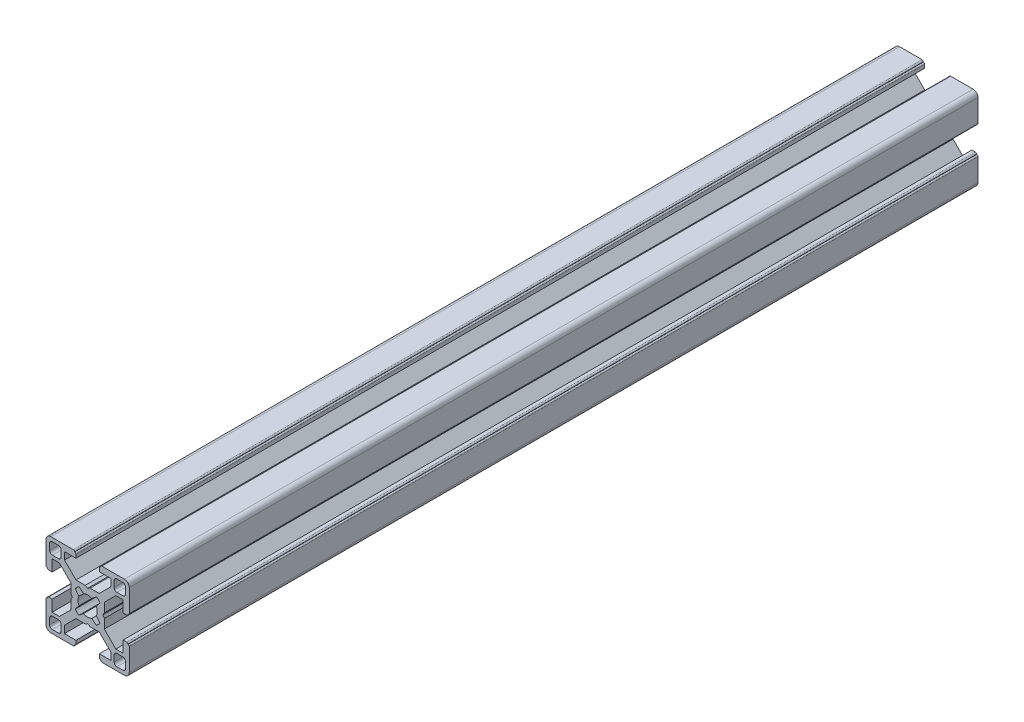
from build123d import *

# Parameters (mm, degrees)
EXTRUSION_3030_DEPTH  = 152.4
PATTERN_EXTRUDE_COUNT = 4


with BuildPart() as part:
    # Sketch1 → Extrusion_3030 (new, symmetric)
    with BuildSketch(Plane.XY):
        with BuildLine():
            Line((-8.325, 12.75), (-4.2, 12.75))
            Line((-4.2, 12.75), (-4.2, 14))
            ThreePointArc((-4.2, 14), (-4.331801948, 14.318198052), (-4.65, 14.45))
            Line((-4.65, 14.45), (-4.7, 14.45))
            Line((-4.7, 14.45), (-4.7, 14.5))
            ThreePointArc((-4.7, 14.5), (-4.831801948, 14.818198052), (-5.15, 14.95))
            Line((-5.15, 14.95), (-13.2, 14.95))
            ThreePointArc((-13.2, 14.95), (-14.437436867, 14.437436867), (-14.95, 13.2))
            Line((-14.95, 13.2), (-14.95, 5.15))
            ThreePointArc((-14.95, 5.15), (-14.818198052, 4.831801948), (-14.5, 4.7))
            Line((-14.5, 4.7), (-14.45, 4.7))
            Line((-14.45, 4.7), (-14.45, 4.65))
            ThreePointArc((-14.45, 4.65), (-14.318198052, 4.331801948), (-14, 4.2))
            Line((-14, 4.2), (-12.75, 4.2))
            Line((-12.75, 4.2), (-12.75, 8.325))
            Line((-12.75, 8.325), (-10.13519336, 8.325))
            Line((-10.13519336, 8.325), (-6, 4.18980664))
            Line((-6, 4.18980664), (-6, 0.875))
            Line((-6, 0.875), (-5.5, 0))
            Line((-5.5, 0), (-3.455011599, 0))
            ThreePointArc((-3.455011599, 0), (-3.369431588, 0.764222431), (-3.116931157, 1.49058556))
            Line((-3.116931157, 1.49058556), (-4.456792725, 3.162787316))
            ThreePointArc((-4.456792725, 3.162787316), (-3.864338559, 3.864338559), (-3.162787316, 4.456792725))
            Line((-3.162787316, 4.456792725), (-1.49058556, 3.116931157))
            ThreePointArc((-1.49058556, 3.116931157), (-0.764222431, 3.369431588), (0, 3.455011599))
            Line((0, 3.455011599), (0, 5.5))
            Line((0, 5.5), (-0.875, 6))
            Line((-0.875, 6), (-4.18980664, 6))
            Line((-4.18980664, 6), (-8.325, 10.13519336))
            Line((-8.325, 10.13519336), (-8.325, 12.75))
        make_face()
        with BuildLine():
            Line((-13.65, 10.5), (-13.65, 12.65))
            ThreePointArc((-13.65, 12.65), (-13.357106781, 13.357106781), (-12.65, 13.65))
            Line((-12.65, 13.65), (-10.5, 13.65))
            ThreePointArc((-10.5, 13.65), (-9.792893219, 13.357106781), (-9.5, 12.65))
            Line((-9.5, 12.65), (-9.5, 10.5))
            ThreePointArc((-9.5, 10.5), (-9.792893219, 9.792893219), (-10.5, 9.5))
            Line((-10.5, 9.5), (-12.65, 9.5))
            ThreePointArc((-12.65, 9.5), (-13.357106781, 9.792893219), (-13.65, 10.5))
        make_face(mode=Mode.SUBTRACT)
    extrusion_3030 = extrude(amount=EXTRUSION_3030_DEPTH, both=True)

    # pattern_extrude: Extrusion_3030 ×4 about axis
    pattern_extrude_axis = Axis((0, 0, 0), (0, 0, 1))
    for i in range(1, PATTERN_EXTRUDE_COUNT):
        add(extrusion_3030.rotate(pattern_extrude_axis, i * 360 / PATTERN_EXTRUDE_COUNT))


solid = part.part
